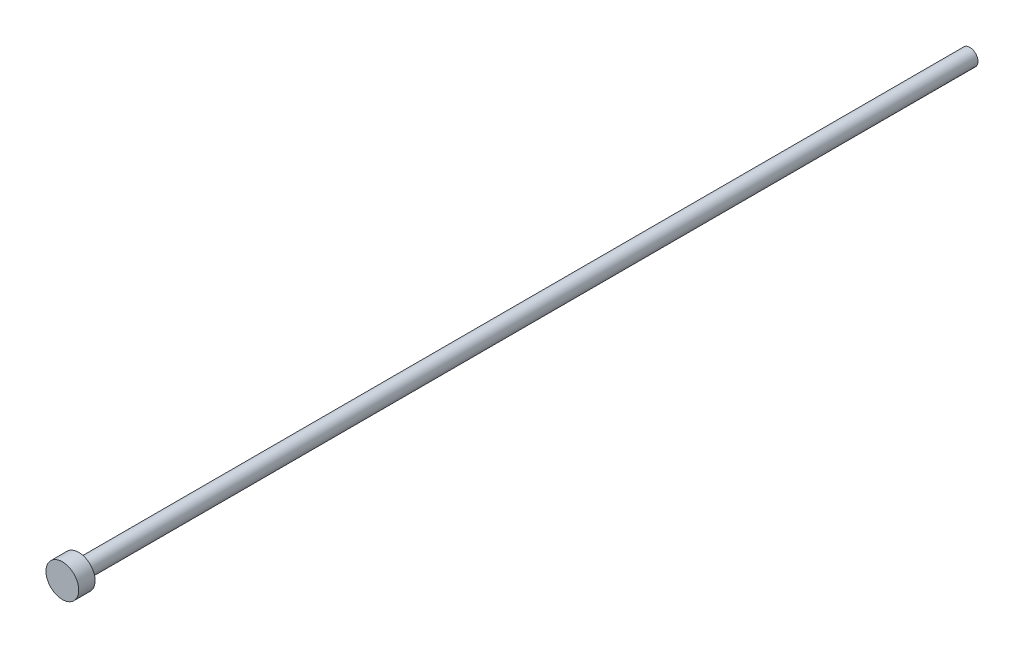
ISO-10303-21;
HEADER;
FILE_DESCRIPTION(('STEP AP214'),'2;1');
FILE_NAME('part.step','',(''),(''),'','','');
FILE_SCHEMA(('AUTOMOTIVE_DESIGN { 1 0 10303 214 1 1 1 1 }'));
ENDSEC;
DATA;
#1=APPLICATION_CONTEXT('core data for automotive mechanical design processes');
#2=APPLICATION_PROTOCOL_DEFINITION('international standard','automotive_design',2000,#1);
#3=PRODUCT_CONTEXT('',#1,'mechanical');
#4=PRODUCT('Part','Part','',(#3));
#5=PRODUCT_RELATED_PRODUCT_CATEGORY('part','',(#4));
#6=PRODUCT_DEFINITION_FORMATION('','',#4);
#7=PRODUCT_DEFINITION_CONTEXT('part definition',#1,'design');
#8=PRODUCT_DEFINITION('design','',#6,#7);
#9=PRODUCT_DEFINITION_SHAPE('','',#8);
#10=(LENGTH_UNIT() NAMED_UNIT(*) SI_UNIT(.MILLI.,.METRE.));
#11=(NAMED_UNIT(*) PLANE_ANGLE_UNIT() SI_UNIT($,.RADIAN.));
#12=(NAMED_UNIT(*) SI_UNIT($,.STERADIAN.) SOLID_ANGLE_UNIT());
#13=UNCERTAINTY_MEASURE_WITH_UNIT(LENGTH_MEASURE(1.E-05),#10,'distance_accuracy_value','');
#14=(GEOMETRIC_REPRESENTATION_CONTEXT(3) GLOBAL_UNCERTAINTY_ASSIGNED_CONTEXT((#13)) GLOBAL_UNIT_ASSIGNED_CONTEXT((#10,
#11,#12)) REPRESENTATION_CONTEXT('',''));
#15=CARTESIAN_POINT('',(0.,0.,0.));
#16=DIRECTION('',(0.,0.,1.));
#17=DIRECTION('',(1.,0.,0.));
#18=AXIS2_PLACEMENT_3D('',#15,#16,#17);
#19=CARTESIAN_POINT('',(0.,0.,-2.));
#20=DIRECTION('',(0.,0.,1.));
#21=DIRECTION('',(1.,0.,0.));
#22=AXIS2_PLACEMENT_3D('',#19,#20,#21);
#23=PLANE('',#22);
#24=CARTESIAN_POINT('',(0.,0.,-2.));
#25=DIRECTION('',(0.,0.,1.));
#26=DIRECTION('',(1.,0.,0.));
#27=AXIS2_PLACEMENT_3D('',#24,#25,#26);
#28=CIRCLE('',#27,1.2);
#29=CARTESIAN_POINT('',(1.2,0.,-2.));
#30=VERTEX_POINT('',#29);
#31=EDGE_CURVE('E11',#30,#30,#28,.T.);
#32=ORIENTED_EDGE('',*,*,#31,.T.);
#33=EDGE_LOOP('',(#32));
#34=FACE_BOUND('',#33,.T.);
#35=CARTESIAN_POINT('',(0.,0.,-2.));
#36=DIRECTION('',(0.,0.,1.));
#37=DIRECTION('',(1.,0.,0.));
#38=AXIS2_PLACEMENT_3D('',#35,#36,#37);
#39=CIRCLE('',#38,2.);
#40=CARTESIAN_POINT('',(2.,0.,-2.));
#41=VERTEX_POINT('',#40);
#42=EDGE_CURVE('E40',#41,#41,#39,.T.);
#43=ORIENTED_EDGE('',*,*,#42,.F.);
#44=EDGE_LOOP('',(#43));
#45=FACE_BOUND('',#44,.T.);
#46=ADVANCED_FACE('F29',(#34,#45),#23,.F.);
#47=CARTESIAN_POINT('',(0.,0.,-2.));
#48=DIRECTION('',(0.,0.,1.));
#49=DIRECTION('',(1.,0.,0.));
#50=AXIS2_PLACEMENT_3D('',#47,#48,#49);
#51=CYLINDRICAL_SURFACE('',#50,2.);
#52=ORIENTED_EDGE('',*,*,#42,.T.);
#53=EDGE_LOOP('',(#52));
#54=FACE_BOUND('',#53,.T.);
#55=CARTESIAN_POINT('',(0.,0.,0.));
#56=DIRECTION('',(0.,0.,1.));
#57=DIRECTION('',(1.,0.,0.));
#58=AXIS2_PLACEMENT_3D('',#55,#56,#57);
#59=CIRCLE('',#58,2.);
#60=CARTESIAN_POINT('',(2.,0.,0.));
#61=VERTEX_POINT('',#60);
#62=EDGE_CURVE('E44',#61,#61,#59,.T.);
#63=ORIENTED_EDGE('',*,*,#62,.F.);
#64=EDGE_LOOP('',(#63));
#65=FACE_BOUND('',#64,.T.);
#66=ADVANCED_FACE('F31',(#54,#65),#51,.T.);
#67=CARTESIAN_POINT('',(0.,0.,0.));
#68=DIRECTION('',(0.,0.,1.));
#69=DIRECTION('',(1.,0.,0.));
#70=AXIS2_PLACEMENT_3D('',#67,#68,#69);
#71=PLANE('',#70);
#72=ORIENTED_EDGE('',*,*,#62,.T.);
#73=EDGE_LOOP('',(#72));
#74=FACE_BOUND('',#73,.T.);
#75=ADVANCED_FACE('F58',(#74),#71,.T.);
#76=CARTESIAN_POINT('',(0.,0.,-252.828427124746));
#77=DIRECTION('',(0.,0.,1.));
#78=DIRECTION('',(1.,0.,0.));
#79=AXIS2_PLACEMENT_3D('',#76,#77,#78);
#80=CYLINDRICAL_SURFACE('',#79,1.);
#81=CARTESIAN_POINT('',(0.,0.,-110.8));
#82=DIRECTION('',(0.,0.,1.));
#83=DIRECTION('',(1.,0.,0.));
#84=AXIS2_PLACEMENT_3D('',#81,#82,#83);
#85=CIRCLE('',#84,1.);
#86=CARTESIAN_POINT('',(1.,0.,-110.8));
#87=VERTEX_POINT('',#86);
#88=EDGE_CURVE('E49',#87,#87,#85,.F.);
#89=ORIENTED_EDGE('',*,*,#88,.F.);
#90=EDGE_LOOP('',(#89));
#91=FACE_BOUND('',#90,.T.);
#92=CARTESIAN_POINT('',(0.,0.,-2.19999999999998));
#93=DIRECTION('',(0.,0.,1.));
#94=DIRECTION('',(1.,0.,0.));
#95=AXIS2_PLACEMENT_3D('',#92,#93,#94);
#96=CIRCLE('',#95,1.);
#97=CARTESIAN_POINT('',(1.,0.,-2.19999999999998));
#98=VERTEX_POINT('',#97);
#99=EDGE_CURVE('E36',#98,#98,#96,.F.);
#100=ORIENTED_EDGE('',*,*,#99,.T.);
#101=EDGE_LOOP('',(#100));
#102=FACE_BOUND('',#101,.T.);
#103=ADVANCED_FACE('F55',(#91,#102),#80,.T.);
#104=CARTESIAN_POINT('',(0.,0.,-2.19999999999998));
#105=DIRECTION('',(0.,0.,1.));
#106=DIRECTION('',(1.,0.,0.));
#107=AXIS2_PLACEMENT_3D('',#104,#105,#106);
#108=TOROIDAL_SURFACE('',#107,1.2,0.2);
#109=ORIENTED_EDGE('',*,*,#31,.F.);
#110=EDGE_LOOP('',(#109));
#111=FACE_BOUND('',#110,.T.);
#112=ORIENTED_EDGE('',*,*,#99,.F.);
#113=EDGE_LOOP('',(#112));
#114=FACE_BOUND('',#113,.T.);
#115=ADVANCED_FACE('F57',(#111,#114),#108,.F.);
#116=CARTESIAN_POINT('',(9.58621050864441,3.7124737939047,-110.8));
#117=DIRECTION('',(0.,0.,1.));
#118=DIRECTION('',(1.,0.,0.));
#119=AXIS2_PLACEMENT_3D('',#116,#117,#118);
#120=PLANE('',#119);
#121=ORIENTED_EDGE('',*,*,#88,.T.);
#122=EDGE_LOOP('',(#121));
#123=FACE_BOUND('',#122,.T.);
#124=ADVANCED_FACE('F53',(#123),#120,.F.);
#125=CLOSED_SHELL('',(#46,#66,#75,#103,#115,#124));
#126=MANIFOLD_SOLID_BREP('B2',#125);
#127=ADVANCED_BREP_SHAPE_REPRESENTATION('',(#18,#126),#14);
#128=SHAPE_DEFINITION_REPRESENTATION(#9,#127);
ENDSEC;
END-ISO-10303-21;
